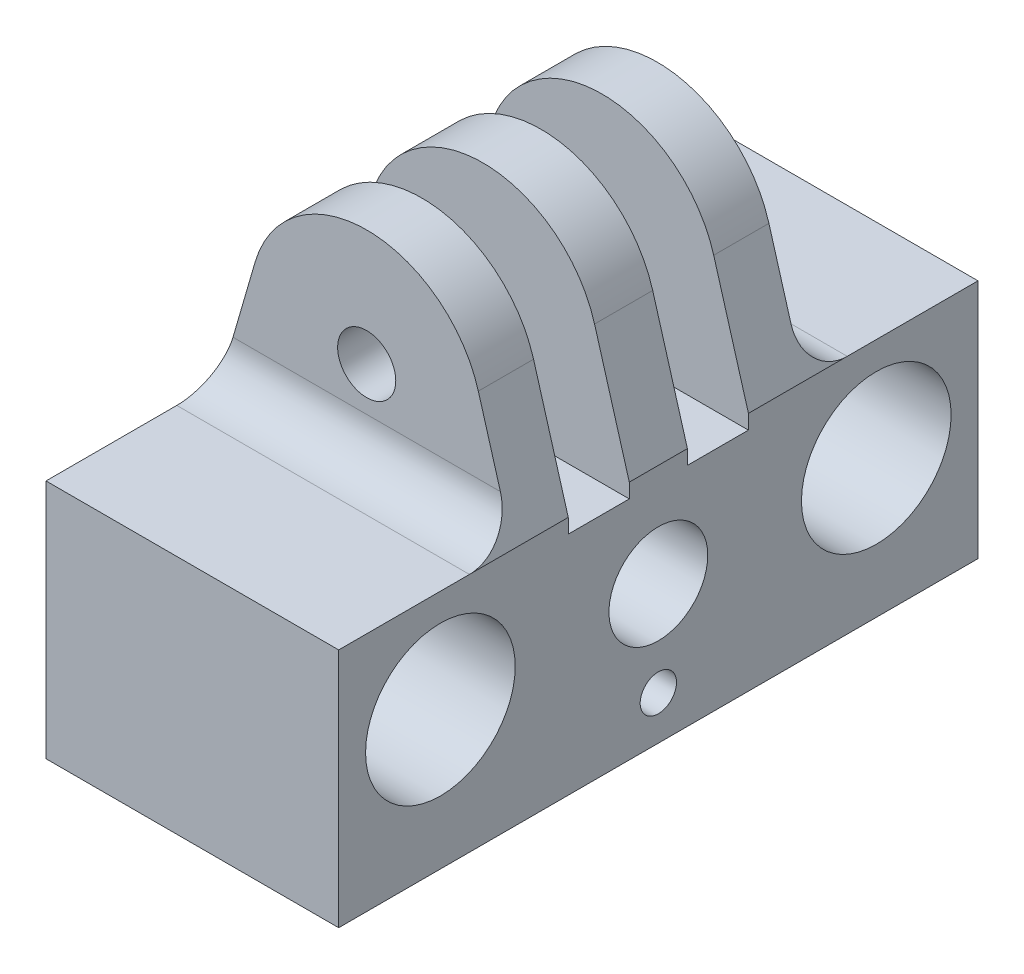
ISO-10303-21;
HEADER;
FILE_DESCRIPTION(('STEP AP214'),'2;1');
FILE_NAME('part.step','',(''),(''),'','','');
FILE_SCHEMA(('AUTOMOTIVE_DESIGN { 1 0 10303 214 1 1 1 1 }'));
ENDSEC;
DATA;
#1=APPLICATION_CONTEXT('core data for automotive mechanical design processes');
#2=APPLICATION_PROTOCOL_DEFINITION('international standard','automotive_design',2000,#1);
#3=PRODUCT_CONTEXT('',#1,'mechanical');
#4=PRODUCT('Part','Part','',(#3));
#5=PRODUCT_RELATED_PRODUCT_CATEGORY('part','',(#4));
#6=PRODUCT_DEFINITION_FORMATION('','',#4);
#7=PRODUCT_DEFINITION_CONTEXT('part definition',#1,'design');
#8=PRODUCT_DEFINITION('design','',#6,#7);
#9=PRODUCT_DEFINITION_SHAPE('','',#8);
#10=(LENGTH_UNIT() NAMED_UNIT(*) SI_UNIT(.MILLI.,.METRE.));
#11=(NAMED_UNIT(*) PLANE_ANGLE_UNIT() SI_UNIT($,.RADIAN.));
#12=(NAMED_UNIT(*) SI_UNIT($,.STERADIAN.) SOLID_ANGLE_UNIT());
#13=UNCERTAINTY_MEASURE_WITH_UNIT(LENGTH_MEASURE(1.E-05),#10,'distance_accuracy_value','');
#14=(GEOMETRIC_REPRESENTATION_CONTEXT(3) GLOBAL_UNCERTAINTY_ASSIGNED_CONTEXT((#13)) GLOBAL_UNIT_ASSIGNED_CONTEXT((#10,
#11,#12)) REPRESENTATION_CONTEXT('',''));
#15=CARTESIAN_POINT('',(0.,0.,0.));
#16=DIRECTION('',(0.,0.,1.));
#17=DIRECTION('',(1.,0.,0.));
#18=AXIS2_PLACEMENT_3D('',#15,#16,#17);
#19=CARTESIAN_POINT('',(0.,0.,20.));
#20=DIRECTION('',(0.,0.,1.));
#21=DIRECTION('',(1.,0.,0.));
#22=AXIS2_PLACEMENT_3D('',#19,#20,#21);
#23=PLANE('',#22);
#24=CARTESIAN_POINT('',(0.,20.,20.));
#25=DIRECTION('',(0.,0.,1.));
#26=DIRECTION('',(1.,0.,0.));
#27=AXIS2_PLACEMENT_3D('',#24,#25,#26);
#28=CIRCLE('',#27,2.);
#29=CARTESIAN_POINT('',(2.,20.,20.));
#30=VERTEX_POINT('',#29);
#31=EDGE_CURVE('E487',#30,#30,#28,.T.);
#32=ORIENTED_EDGE('',*,*,#31,.F.);
#33=EDGE_LOOP('',(#32));
#34=FACE_BOUND('',#33,.T.);
#35=CARTESIAN_POINT('',(0.,20.,20.));
#36=DIRECTION('',(0.,0.,1.));
#37=DIRECTION('',(1.,0.,0.));
#38=AXIS2_PLACEMENT_3D('',#35,#36,#37);
#39=CIRCLE('',#38,8.00008904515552);
#40=CARTESIAN_POINT('',(-7.68287417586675,22.2304414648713,20.));
#41=VERTEX_POINT('',#40);
#42=CARTESIAN_POINT('',(7.68287417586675,22.2304414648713,20.));
#43=VERTEX_POINT('',#42);
#44=EDGE_CURVE('E251',#41,#43,#39,.F.);
#45=ORIENTED_EDGE('',*,*,#44,.F.);
#46=DIRECTION('',(-0.278802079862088,-0.960348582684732,0.));
#47=VECTOR('',#46,1.);
#48=CARTESIAN_POINT('',(-13.037817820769,3.78505345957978,20.));
#49=LINE('',#48,#47);
#50=CARTESIAN_POINT('',(-9.20134151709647,17.,20.));
#51=VERTEX_POINT('',#50);
#52=EDGE_CURVE('E289',#41,#51,#49,.T.);
#53=ORIENTED_EDGE('',*,*,#52,.T.);
#54=DIRECTION('',(-1.,0.,0.));
#55=VECTOR('',#54,1.);
#56=CARTESIAN_POINT('',(10.0722817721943,17.,20.));
#57=LINE('',#56,#55);
#58=CARTESIAN_POINT('',(9.20134151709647,17.,20.));
#59=VERTEX_POINT('',#58);
#60=EDGE_CURVE('E271',#51,#59,#57,.F.);
#61=ORIENTED_EDGE('',*,*,#60,.T.);
#62=DIRECTION('',(0.278802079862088,-0.960348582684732,0.));
#63=VECTOR('',#62,1.);
#64=CARTESIAN_POINT('',(13.037817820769,3.78505345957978,20.));
#65=LINE('',#64,#63);
#66=EDGE_CURVE('E73',#43,#59,#65,.T.);
#67=ORIENTED_EDGE('',*,*,#66,.F.);
#68=EDGE_LOOP('',(#45,#53,#61,#67));
#69=FACE_BOUND('',#68,.T.);
#70=ADVANCED_FACE('F50',(#34,#69),#23,.T.);
#71=CARTESIAN_POINT('',(0.,0.,0.));
#72=DIRECTION('',(0.,0.,1.));
#73=DIRECTION('',(1.,0.,0.));
#74=AXIS2_PLACEMENT_3D('',#71,#72,#73);
#75=PLANE('',#74);
#76=CARTESIAN_POINT('',(0.,20.,0.));
#77=DIRECTION('',(0.,0.,1.));
#78=DIRECTION('',(1.,0.,0.));
#79=AXIS2_PLACEMENT_3D('',#76,#77,#78);
#80=CIRCLE('',#79,2.);
#81=CARTESIAN_POINT('',(2.,20.,0.));
#82=VERTEX_POINT('',#81);
#83=EDGE_CURVE('E485',#82,#82,#80,.T.);
#84=ORIENTED_EDGE('',*,*,#83,.T.);
#85=EDGE_LOOP('',(#84));
#86=FACE_BOUND('',#85,.T.);
#87=DIRECTION('',(-0.278802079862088,-0.960348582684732,0.));
#88=VECTOR('',#87,1.);
#89=CARTESIAN_POINT('',(-13.037817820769,3.78505345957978,0.));
#90=LINE('',#89,#88);
#91=CARTESIAN_POINT('',(-7.68287417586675,22.2304414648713,0.));
#92=VERTEX_POINT('',#91);
#93=CARTESIAN_POINT('',(-9.20134151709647,17.,0.));
#94=VERTEX_POINT('',#93);
#95=EDGE_CURVE('E285',#92,#94,#90,.T.);
#96=ORIENTED_EDGE('',*,*,#95,.F.);
#97=CARTESIAN_POINT('',(0.,20.,0.));
#98=DIRECTION('',(0.,0.,1.));
#99=DIRECTION('',(1.,0.,0.));
#100=AXIS2_PLACEMENT_3D('',#97,#98,#99);
#101=CIRCLE('',#100,8.00008904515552);
#102=CARTESIAN_POINT('',(7.68287417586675,22.2304414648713,0.));
#103=VERTEX_POINT('',#102);
#104=EDGE_CURVE('E260',#92,#103,#101,.F.);
#105=ORIENTED_EDGE('',*,*,#104,.T.);
#106=DIRECTION('',(0.278802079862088,-0.960348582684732,0.));
#107=VECTOR('',#106,1.);
#108=CARTESIAN_POINT('',(13.037817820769,3.78505345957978,0.));
#109=LINE('',#108,#107);
#110=CARTESIAN_POINT('',(9.20134151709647,17.,0.));
#111=VERTEX_POINT('',#110);
#112=EDGE_CURVE('E277',#103,#111,#109,.T.);
#113=ORIENTED_EDGE('',*,*,#112,.T.);
#114=DIRECTION('',(-1.,0.,0.));
#115=VECTOR('',#114,1.);
#116=CARTESIAN_POINT('',(0.,17.,0.));
#117=LINE('',#116,#115);
#118=EDGE_CURVE('E501',#111,#94,#117,.T.);
#119=ORIENTED_EDGE('',*,*,#118,.T.);
#120=EDGE_LOOP('',(#96,#105,#113,#119));
#121=FACE_BOUND('',#120,.T.);
#122=ADVANCED_FACE('F585',(#86,#121),#75,.F.);
#123=CARTESIAN_POINT('',(0.,20.,8.));
#124=DIRECTION('',(0.,0.,-1.));
#125=DIRECTION('',(-1.,0.,0.));
#126=AXIS2_PLACEMENT_3D('',#123,#124,#125);
#127=PLANE('',#126);
#128=CARTESIAN_POINT('',(0.,20.,8.));
#129=DIRECTION('',(0.,0.,-1.));
#130=DIRECTION('',(-1.,0.,0.));
#131=AXIS2_PLACEMENT_3D('',#128,#129,#130);
#132=CIRCLE('',#131,2.);
#133=CARTESIAN_POINT('',(-2.,20.,8.));
#134=VERTEX_POINT('',#133);
#135=EDGE_CURVE('E477',#134,#134,#132,.T.);
#136=ORIENTED_EDGE('',*,*,#135,.F.);
#137=EDGE_LOOP('',(#136));
#138=FACE_BOUND('',#137,.T.);
#139=DIRECTION('',(0.,1.,0.));
#140=VECTOR('',#139,1.);
#141=CARTESIAN_POINT('',(-10.0722817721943,20.,8.));
#142=LINE('',#141,#140);
#143=CARTESIAN_POINT('',(-10.0722817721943,13.,8.));
#144=VERTEX_POINT('',#143);
#145=CARTESIAN_POINT('',(-10.0722817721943,14.,8.));
#146=VERTEX_POINT('',#145);
#147=EDGE_CURVE('E470',#144,#146,#142,.T.);
#148=ORIENTED_EDGE('',*,*,#147,.T.);
#149=DIRECTION('',(0.278802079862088,0.960348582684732,0.));
#150=VECTOR('',#149,1.);
#151=CARTESIAN_POINT('',(-7.68287417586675,22.2304414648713,8.));
#152=LINE('',#151,#150);
#153=CARTESIAN_POINT('',(-7.68287417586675,22.2304414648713,8.));
#154=VERTEX_POINT('',#153);
#155=EDGE_CURVE('E297',#146,#154,#152,.T.);
#156=ORIENTED_EDGE('',*,*,#155,.T.);
#157=CARTESIAN_POINT('',(0.,20.,8.));
#158=DIRECTION('',(0.,0.,-1.));
#159=DIRECTION('',(-1.,0.,0.));
#160=AXIS2_PLACEMENT_3D('',#157,#158,#159);
#161=CIRCLE('',#160,8.00008904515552);
#162=CARTESIAN_POINT('',(7.68287417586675,22.2304414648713,8.));
#163=VERTEX_POINT('',#162);
#164=EDGE_CURVE('E305',#163,#154,#161,.F.);
#165=ORIENTED_EDGE('',*,*,#164,.F.);
#166=DIRECTION('',(-0.278802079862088,0.960348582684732,0.));
#167=VECTOR('',#166,1.);
#168=CARTESIAN_POINT('',(7.68287417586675,22.2304414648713,8.));
#169=LINE('',#168,#167);
#170=CARTESIAN_POINT('',(10.0722817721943,14.,8.));
#171=VERTEX_POINT('',#170);
#172=EDGE_CURVE('E283',#171,#163,#169,.T.);
#173=ORIENTED_EDGE('',*,*,#172,.F.);
#174=DIRECTION('',(0.,-1.,0.));
#175=VECTOR('',#174,1.);
#176=CARTESIAN_POINT('',(10.0722817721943,20.,8.));
#177=LINE('',#176,#175);
#178=CARTESIAN_POINT('',(10.0722817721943,13.,8.));
#179=VERTEX_POINT('',#178);
#180=EDGE_CURVE('E462',#171,#179,#177,.T.);
#181=ORIENTED_EDGE('',*,*,#180,.T.);
#182=DIRECTION('',(-1.,0.,0.));
#183=VECTOR('',#182,1.);
#184=CARTESIAN_POINT('',(10.875,13.,8.));
#185=LINE('',#184,#183);
#186=EDGE_CURVE('E483',#179,#144,#185,.T.);
#187=ORIENTED_EDGE('',*,*,#186,.T.);
#188=EDGE_LOOP('',(#148,#156,#165,#173,#181,#187));
#189=FACE_BOUND('',#188,.T.);
#190=ADVANCED_FACE('F651',(#138,#189),#127,.T.);
#191=CARTESIAN_POINT('',(0.,20.,12.));
#192=DIRECTION('',(0.,0.,-1.));
#193=DIRECTION('',(-1.,0.,0.));
#194=AXIS2_PLACEMENT_3D('',#191,#192,#193);
#195=PLANE('',#194);
#196=CARTESIAN_POINT('',(0.,20.,12.));
#197=DIRECTION('',(0.,0.,-1.));
#198=DIRECTION('',(-1.,0.,0.));
#199=AXIS2_PLACEMENT_3D('',#196,#197,#198);
#200=CIRCLE('',#199,2.);
#201=CARTESIAN_POINT('',(-2.,20.,12.));
#202=VERTEX_POINT('',#201);
#203=EDGE_CURVE('E476',#202,#202,#200,.T.);
#204=ORIENTED_EDGE('',*,*,#203,.T.);
#205=EDGE_LOOP('',(#204));
#206=FACE_BOUND('',#205,.T.);
#207=DIRECTION('',(0.278802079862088,0.960348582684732,0.));
#208=VECTOR('',#207,1.);
#209=CARTESIAN_POINT('',(-7.68287417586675,22.2304414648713,12.));
#210=LINE('',#209,#208);
#211=CARTESIAN_POINT('',(-10.0722817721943,14.,12.));
#212=VERTEX_POINT('',#211);
#213=CARTESIAN_POINT('',(-7.68287417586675,22.2304414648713,12.));
#214=VERTEX_POINT('',#213);
#215=EDGE_CURVE('E295',#212,#214,#210,.T.);
#216=ORIENTED_EDGE('',*,*,#215,.F.);
#217=DIRECTION('',(0.,1.,0.));
#218=VECTOR('',#217,1.);
#219=CARTESIAN_POINT('',(-10.0722817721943,20.,12.));
#220=LINE('',#219,#218);
#221=CARTESIAN_POINT('',(-10.0722817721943,13.,12.));
#222=VERTEX_POINT('',#221);
#223=EDGE_CURVE('E490',#222,#212,#220,.T.);
#224=ORIENTED_EDGE('',*,*,#223,.F.);
#225=DIRECTION('',(-1.,0.,0.));
#226=VECTOR('',#225,1.);
#227=CARTESIAN_POINT('',(10.875,13.,12.));
#228=LINE('',#227,#226);
#229=CARTESIAN_POINT('',(10.0722817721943,13.,12.));
#230=VERTEX_POINT('',#229);
#231=EDGE_CURVE('E480',#230,#222,#228,.T.);
#232=ORIENTED_EDGE('',*,*,#231,.F.);
#233=DIRECTION('',(0.,-1.,0.));
#234=VECTOR('',#233,1.);
#235=CARTESIAN_POINT('',(10.0722817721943,20.,12.));
#236=LINE('',#235,#234);
#237=CARTESIAN_POINT('',(10.0722817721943,14.,12.));
#238=VERTEX_POINT('',#237);
#239=EDGE_CURVE('E457',#238,#230,#236,.T.);
#240=ORIENTED_EDGE('',*,*,#239,.F.);
#241=DIRECTION('',(-0.278802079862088,0.960348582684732,0.));
#242=VECTOR('',#241,1.);
#243=CARTESIAN_POINT('',(7.68287417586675,22.2304414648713,12.));
#244=LINE('',#243,#242);
#245=CARTESIAN_POINT('',(7.68287417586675,22.2304414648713,12.));
#246=VERTEX_POINT('',#245);
#247=EDGE_CURVE('E65',#238,#246,#244,.T.);
#248=ORIENTED_EDGE('',*,*,#247,.T.);
#249=CARTESIAN_POINT('',(0.,20.,12.));
#250=DIRECTION('',(0.,0.,-1.));
#251=DIRECTION('',(-1.,0.,0.));
#252=AXIS2_PLACEMENT_3D('',#249,#250,#251);
#253=CIRCLE('',#252,8.00008904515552);
#254=EDGE_CURVE('E302',#246,#214,#253,.F.);
#255=ORIENTED_EDGE('',*,*,#254,.T.);
#256=EDGE_LOOP('',(#216,#224,#232,#240,#248,#255));
#257=FACE_BOUND('',#256,.T.);
#258=ADVANCED_FACE('F866',(#206,#257),#195,.F.);
#259=CARTESIAN_POINT('',(-10.0722817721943,0.,-11.));
#260=DIRECTION('',(-1.,0.,0.));
#261=DIRECTION('',(0.,-1.,0.));
#262=AXIS2_PLACEMENT_3D('',#259,#260,#261);
#263=PLANE('',#262);
#264=CARTESIAN_POINT('',(-10.0722817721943,6.94401265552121,10.));
#265=DIRECTION('',(-1.,0.,0.));
#266=DIRECTION('',(0.,-1.,0.));
#267=AXIS2_PLACEMENT_3D('',#264,#265,#266);
#268=CIRCLE('',#267,3.4);
#269=CARTESIAN_POINT('',(-10.0722817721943,3.54401265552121,10.));
#270=VERTEX_POINT('',#269);
#271=EDGE_CURVE('E454',#270,#270,#268,.T.);
#272=ORIENTED_EDGE('',*,*,#271,.F.);
#273=EDGE_LOOP('',(#272));
#274=FACE_BOUND('',#273,.T.);
#275=CARTESIAN_POINT('',(-10.0722817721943,6.94401265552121,-5.));
#276=DIRECTION('',(-1.,0.,0.));
#277=DIRECTION('',(0.,-1.,0.));
#278=AXIS2_PLACEMENT_3D('',#275,#276,#277);
#279=CIRCLE('',#278,5.15);
#280=CARTESIAN_POINT('',(-10.0722817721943,1.79401265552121,-5.));
#281=VERTEX_POINT('',#280);
#282=EDGE_CURVE('E360',#281,#281,#279,.T.);
#283=ORIENTED_EDGE('',*,*,#282,.F.);
#284=EDGE_LOOP('',(#283));
#285=FACE_BOUND('',#284,.T.);
#286=CARTESIAN_POINT('',(-10.0722817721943,6.94401265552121,25.));
#287=DIRECTION('',(-1.,0.,0.));
#288=DIRECTION('',(0.,-1.,0.));
#289=AXIS2_PLACEMENT_3D('',#286,#287,#288);
#290=CIRCLE('',#289,5.15);
#291=CARTESIAN_POINT('',(-10.0722817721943,1.79401265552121,25.));
#292=VERTEX_POINT('',#291);
#293=EDGE_CURVE('E354',#292,#292,#290,.T.);
#294=ORIENTED_EDGE('',*,*,#293,.F.);
#295=EDGE_LOOP('',(#294));
#296=FACE_BOUND('',#295,.T.);
#297=CARTESIAN_POINT('',(-10.0722817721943,0.444012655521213,10.));
#298=DIRECTION('',(-1.,0.,0.));
#299=DIRECTION('',(0.,-1.,0.));
#300=AXIS2_PLACEMENT_3D('',#297,#298,#299);
#301=CIRCLE('',#300,1.25);
#302=CARTESIAN_POINT('',(-10.0722817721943,-0.805987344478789,10.));
#303=VERTEX_POINT('',#302);
#304=EDGE_CURVE('E315',#303,#303,#301,.T.);
#305=ORIENTED_EDGE('',*,*,#304,.F.);
#306=EDGE_LOOP('',(#305));
#307=FACE_BOUND('',#306,.T.);
#308=DIRECTION('',(0.,0.,-1.));
#309=VECTOR('',#308,1.);
#310=CARTESIAN_POINT('',(-10.0722817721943,14.,20.));
#311=LINE('',#310,#309);
#312=CARTESIAN_POINT('',(-10.0722817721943,14.,32.));
#313=VERTEX_POINT('',#312);
#314=CARTESIAN_POINT('',(-10.0722817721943,14.,23.));
#315=VERTEX_POINT('',#314);
#316=EDGE_CURVE('E366',#313,#315,#311,.T.);
#317=ORIENTED_EDGE('',*,*,#316,.T.);
#318=DIRECTION('',(0.,0.,-1.));
#319=VECTOR('',#318,1.);
#320=CARTESIAN_POINT('',(-10.0722817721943,14.,30.));
#321=LINE('',#320,#319);
#322=CARTESIAN_POINT('',(-10.0722817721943,14.,16.2));
#323=VERTEX_POINT('',#322);
#324=EDGE_CURVE('E586',#315,#323,#321,.T.);
#325=ORIENTED_EDGE('',*,*,#324,.T.);
#326=DIRECTION('',(0.,1.,0.));
#327=VECTOR('',#326,1.);
#328=CARTESIAN_POINT('',(-10.0722817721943,0.,16.2));
#329=LINE('',#328,#327);
#330=CARTESIAN_POINT('',(-10.0722817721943,13.,16.2));
#331=VERTEX_POINT('',#330);
#332=EDGE_CURVE('E403',#331,#323,#329,.T.);
#333=ORIENTED_EDGE('',*,*,#332,.F.);
#334=DIRECTION('',(0.,0.,-1.));
#335=VECTOR('',#334,1.);
#336=CARTESIAN_POINT('',(-10.0722817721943,13.,0.));
#337=LINE('',#336,#335);
#338=EDGE_CURVE('E467',#331,#222,#337,.T.);
#339=ORIENTED_EDGE('',*,*,#338,.T.);
#340=ORIENTED_EDGE('',*,*,#223,.T.);
#341=EDGE_CURVE('E588',#212,#146,#321,.T.);
#342=ORIENTED_EDGE('',*,*,#341,.T.);
#343=ORIENTED_EDGE('',*,*,#147,.F.);
#344=DIRECTION('',(0.,0.,-1.));
#345=VECTOR('',#344,1.);
#346=CARTESIAN_POINT('',(-10.0722817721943,13.,0.));
#347=LINE('',#346,#345);
#348=CARTESIAN_POINT('',(-10.0722817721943,13.,3.8));
#349=VERTEX_POINT('',#348);
#350=EDGE_CURVE('E473',#144,#349,#347,.T.);
#351=ORIENTED_EDGE('',*,*,#350,.T.);
#352=DIRECTION('',(0.,-1.,0.));
#353=VECTOR('',#352,1.);
#354=CARTESIAN_POINT('',(-10.0722817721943,0.,3.8));
#355=LINE('',#354,#353);
#356=CARTESIAN_POINT('',(-10.0722817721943,14.,3.8));
#357=VERTEX_POINT('',#356);
#358=EDGE_CURVE('E395',#357,#349,#355,.T.);
#359=ORIENTED_EDGE('',*,*,#358,.F.);
#360=CARTESIAN_POINT('',(-10.0722817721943,14.,-3.));
#361=VERTEX_POINT('',#360);
#362=EDGE_CURVE('E590',#357,#361,#321,.T.);
#363=ORIENTED_EDGE('',*,*,#362,.T.);
#364=DIRECTION('',(0.,0.,-1.));
#365=VECTOR('',#364,1.);
#366=CARTESIAN_POINT('',(-10.0722817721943,14.,-12.));
#367=LINE('',#366,#365);
#368=CARTESIAN_POINT('',(-10.0722817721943,14.,-12.));
#369=VERTEX_POINT('',#368);
#370=EDGE_CURVE('E371',#361,#369,#367,.T.);
#371=ORIENTED_EDGE('',*,*,#370,.T.);
#372=DIRECTION('',(0.,1.,0.));
#373=VECTOR('',#372,1.);
#374=CARTESIAN_POINT('',(-10.0722817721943,13.,-12.));
#375=LINE('',#374,#373);
#376=CARTESIAN_POINT('',(-10.0722817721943,-2.56000000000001,-12.));
#377=VERTEX_POINT('',#376);
#378=EDGE_CURVE('E384',#377,#369,#375,.T.);
#379=ORIENTED_EDGE('',*,*,#378,.F.);
#380=DIRECTION('',(0.,0.,-1.));
#381=VECTOR('',#380,1.);
#382=CARTESIAN_POINT('',(-10.0722817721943,-2.56000000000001,32.));
#383=LINE('',#382,#381);
#384=CARTESIAN_POINT('',(-10.0722817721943,-2.56000000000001,32.));
#385=VERTEX_POINT('',#384);
#386=EDGE_CURVE('E351',#385,#377,#383,.T.);
#387=ORIENTED_EDGE('',*,*,#386,.F.);
#388=DIRECTION('',(0.,-1.,0.));
#389=VECTOR('',#388,1.);
#390=CARTESIAN_POINT('',(-10.0722817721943,13.,32.));
#391=LINE('',#390,#389);
#392=EDGE_CURVE('E380',#313,#385,#391,.T.);
#393=ORIENTED_EDGE('',*,*,#392,.F.);
#394=EDGE_LOOP('',(#317,#325,#333,#339,#340,#342,#343,#351,#359,#363,#371,#379,#387,#393));
#395=FACE_BOUND('',#394,.T.);
#396=ADVANCED_FACE('F556',(#274,#285,#296,#307,#395),#263,.T.);
#397=CARTESIAN_POINT('',(10.0722817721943,0.,-11.));
#398=DIRECTION('',(1.,0.,0.));
#399=DIRECTION('',(0.,0.,-1.));
#400=AXIS2_PLACEMENT_3D('',#397,#398,#399);
#401=PLANE('',#400);
#402=CARTESIAN_POINT('',(10.0722817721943,6.94401265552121,10.));
#403=DIRECTION('',(1.,0.,0.));
#404=DIRECTION('',(0.,0.,-1.));
#405=AXIS2_PLACEMENT_3D('',#402,#403,#404);
#406=CIRCLE('',#405,3.4);
#407=CARTESIAN_POINT('',(10.0722817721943,6.94401265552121,6.6));
#408=VERTEX_POINT('',#407);
#409=EDGE_CURVE('E451',#408,#408,#406,.T.);
#410=ORIENTED_EDGE('',*,*,#409,.F.);
#411=EDGE_LOOP('',(#410));
#412=FACE_BOUND('',#411,.T.);
#413=CARTESIAN_POINT('',(10.0722817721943,6.94401265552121,-5.));
#414=DIRECTION('',(1.,0.,0.));
#415=DIRECTION('',(0.,0.,-1.));
#416=AXIS2_PLACEMENT_3D('',#413,#414,#415);
#417=CIRCLE('',#416,5.15);
#418=CARTESIAN_POINT('',(10.0722817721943,6.94401265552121,-10.15));
#419=VERTEX_POINT('',#418);
#420=EDGE_CURVE('E363',#419,#419,#417,.T.);
#421=ORIENTED_EDGE('',*,*,#420,.F.);
#422=EDGE_LOOP('',(#421));
#423=FACE_BOUND('',#422,.T.);
#424=CARTESIAN_POINT('',(10.0722817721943,6.94401265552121,25.));
#425=DIRECTION('',(1.,0.,0.));
#426=DIRECTION('',(0.,0.,-1.));
#427=AXIS2_PLACEMENT_3D('',#424,#425,#426);
#428=CIRCLE('',#427,5.15);
#429=CARTESIAN_POINT('',(10.0722817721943,6.94401265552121,19.85));
#430=VERTEX_POINT('',#429);
#431=EDGE_CURVE('E357',#430,#430,#428,.T.);
#432=ORIENTED_EDGE('',*,*,#431,.F.);
#433=EDGE_LOOP('',(#432));
#434=FACE_BOUND('',#433,.T.);
#435=CARTESIAN_POINT('',(10.0722817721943,0.444012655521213,10.));
#436=DIRECTION('',(1.,0.,0.));
#437=DIRECTION('',(0.,0.,-1.));
#438=AXIS2_PLACEMENT_3D('',#435,#436,#437);
#439=CIRCLE('',#438,1.25);
#440=CARTESIAN_POINT('',(10.0722817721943,0.444012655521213,8.75));
#441=VERTEX_POINT('',#440);
#442=EDGE_CURVE('E259',#441,#441,#439,.T.);
#443=ORIENTED_EDGE('',*,*,#442,.F.);
#444=EDGE_LOOP('',(#443));
#445=FACE_BOUND('',#444,.T.);
#446=DIRECTION('',(0.,0.,-1.));
#447=VECTOR('',#446,1.);
#448=CARTESIAN_POINT('',(10.0722817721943,14.,-12.));
#449=LINE('',#448,#447);
#450=CARTESIAN_POINT('',(10.0722817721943,14.,-3.));
#451=VERTEX_POINT('',#450);
#452=CARTESIAN_POINT('',(10.0722817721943,14.,-12.));
#453=VERTEX_POINT('',#452);
#454=EDGE_CURVE('E375',#451,#453,#449,.T.);
#455=ORIENTED_EDGE('',*,*,#454,.F.);
#456=DIRECTION('',(0.,0.,-1.));
#457=VECTOR('',#456,1.);
#458=CARTESIAN_POINT('',(10.0722817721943,14.,30.));
#459=LINE('',#458,#457);
#460=CARTESIAN_POINT('',(10.0722817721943,14.,3.8));
#461=VERTEX_POINT('',#460);
#462=EDGE_CURVE('E567',#461,#451,#459,.T.);
#463=ORIENTED_EDGE('',*,*,#462,.F.);
#464=DIRECTION('',(0.,1.,0.));
#465=VECTOR('',#464,1.);
#466=CARTESIAN_POINT('',(10.0722817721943,13.,3.8));
#467=LINE('',#466,#465);
#468=CARTESIAN_POINT('',(10.0722817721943,13.,3.8));
#469=VERTEX_POINT('',#468);
#470=EDGE_CURVE('E389',#469,#461,#467,.T.);
#471=ORIENTED_EDGE('',*,*,#470,.F.);
#472=DIRECTION('',(0.,0.,1.));
#473=VECTOR('',#472,1.);
#474=CARTESIAN_POINT('',(10.0722817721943,13.,0.));
#475=LINE('',#474,#473);
#476=EDGE_CURVE('E464',#469,#179,#475,.T.);
#477=ORIENTED_EDGE('',*,*,#476,.T.);
#478=ORIENTED_EDGE('',*,*,#180,.F.);
#479=EDGE_CURVE('E597',#238,#171,#459,.T.);
#480=ORIENTED_EDGE('',*,*,#479,.F.);
#481=ORIENTED_EDGE('',*,*,#239,.T.);
#482=DIRECTION('',(0.,0.,1.));
#483=VECTOR('',#482,1.);
#484=CARTESIAN_POINT('',(10.0722817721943,13.,0.));
#485=LINE('',#484,#483);
#486=CARTESIAN_POINT('',(10.0722817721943,13.,16.2));
#487=VERTEX_POINT('',#486);
#488=EDGE_CURVE('E459',#230,#487,#485,.T.);
#489=ORIENTED_EDGE('',*,*,#488,.T.);
#490=DIRECTION('',(0.,-1.,0.));
#491=VECTOR('',#490,1.);
#492=CARTESIAN_POINT('',(10.0722817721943,0.,16.2));
#493=LINE('',#492,#491);
#494=CARTESIAN_POINT('',(10.0722817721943,14.,16.2));
#495=VERTEX_POINT('',#494);
#496=EDGE_CURVE('E495',#495,#487,#493,.T.);
#497=ORIENTED_EDGE('',*,*,#496,.F.);
#498=CARTESIAN_POINT('',(10.0722817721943,14.,23.));
#499=VERTEX_POINT('',#498);
#500=EDGE_CURVE('E596',#499,#495,#459,.T.);
#501=ORIENTED_EDGE('',*,*,#500,.F.);
#502=DIRECTION('',(0.,0.,-1.));
#503=VECTOR('',#502,1.);
#504=CARTESIAN_POINT('',(10.0722817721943,14.,20.));
#505=LINE('',#504,#503);
#506=CARTESIAN_POINT('',(10.0722817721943,14.,32.));
#507=VERTEX_POINT('',#506);
#508=EDGE_CURVE('E369',#507,#499,#505,.T.);
#509=ORIENTED_EDGE('',*,*,#508,.F.);
#510=DIRECTION('',(0.,1.,0.));
#511=VECTOR('',#510,1.);
#512=CARTESIAN_POINT('',(10.0722817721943,0.,32.));
#513=LINE('',#512,#511);
#514=CARTESIAN_POINT('',(10.0722817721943,-2.56,32.));
#515=VERTEX_POINT('',#514);
#516=EDGE_CURVE('E382',#515,#507,#513,.T.);
#517=ORIENTED_EDGE('',*,*,#516,.F.);
#518=DIRECTION('',(0.,0.,1.));
#519=VECTOR('',#518,1.);
#520=CARTESIAN_POINT('',(10.0722817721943,-2.56,-12.));
#521=LINE('',#520,#519);
#522=CARTESIAN_POINT('',(10.0722817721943,-2.56,-12.));
#523=VERTEX_POINT('',#522);
#524=EDGE_CURVE('E345',#523,#515,#521,.T.);
#525=ORIENTED_EDGE('',*,*,#524,.F.);
#526=DIRECTION('',(0.,-1.,0.));
#527=VECTOR('',#526,1.);
#528=CARTESIAN_POINT('',(10.0722817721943,0.,-12.));
#529=LINE('',#528,#527);
#530=EDGE_CURVE('E387',#453,#523,#529,.T.);
#531=ORIENTED_EDGE('',*,*,#530,.F.);
#532=EDGE_LOOP('',(#455,#463,#471,#477,#478,#480,#481,#489,#497,#501,#509,#517,#525,#531));
#533=FACE_BOUND('',#532,.T.);
#534=ADVANCED_FACE('F552',(#412,#423,#434,#445,#533),#401,.T.);
#535=CARTESIAN_POINT('',(-15.9277182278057,13.,16.2));
#536=DIRECTION('',(0.,0.,1.));
#537=DIRECTION('',(1.,0.,0.));
#538=AXIS2_PLACEMENT_3D('',#535,#536,#537);
#539=PLANE('',#538);
#540=CARTESIAN_POINT('',(0.,20.,16.2));
#541=DIRECTION('',(0.,0.,1.));
#542=DIRECTION('',(1.,0.,0.));
#543=AXIS2_PLACEMENT_3D('',#540,#541,#542);
#544=CIRCLE('',#543,2.);
#545=CARTESIAN_POINT('',(2.,20.,16.2));
#546=VERTEX_POINT('',#545);
#547=EDGE_CURVE('E406',#546,#546,#544,.T.);
#548=ORIENTED_EDGE('',*,*,#547,.T.);
#549=EDGE_LOOP('',(#548));
#550=FACE_BOUND('',#549,.T.);
#551=DIRECTION('',(-0.278802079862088,-0.960348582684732,0.));
#552=VECTOR('',#551,1.);
#553=CARTESIAN_POINT('',(-10.7951755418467,11.5099539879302,16.2));
#554=LINE('',#553,#552);
#555=CARTESIAN_POINT('',(-7.68287417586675,22.2304414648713,16.2));
#556=VERTEX_POINT('',#555);
#557=EDGE_CURVE('E293',#556,#323,#554,.T.);
#558=ORIENTED_EDGE('',*,*,#557,.F.);
#559=CARTESIAN_POINT('',(0.,20.,16.2));
#560=DIRECTION('',(0.,0.,1.));
#561=DIRECTION('',(1.,0.,0.));
#562=AXIS2_PLACEMENT_3D('',#559,#560,#561);
#563=CIRCLE('',#562,8.00008904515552);
#564=CARTESIAN_POINT('',(7.68287417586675,22.2304414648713,16.2));
#565=VERTEX_POINT('',#564);
#566=EDGE_CURVE('E300',#556,#565,#563,.F.);
#567=ORIENTED_EDGE('',*,*,#566,.T.);
#568=DIRECTION('',(0.278802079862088,-0.960348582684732,0.));
#569=VECTOR('',#568,1.);
#570=CARTESIAN_POINT('',(8.31903336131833,20.0391573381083,16.2));
#571=LINE('',#570,#569);
#572=EDGE_CURVE('E264',#565,#495,#571,.T.);
#573=ORIENTED_EDGE('',*,*,#572,.T.);
#574=ORIENTED_EDGE('',*,*,#496,.T.);
#575=DIRECTION('',(1.,0.,0.));
#576=VECTOR('',#575,1.);
#577=CARTESIAN_POINT('',(-15.9277182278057,13.,16.2));
#578=LINE('',#577,#576);
#579=EDGE_CURVE('E400',#331,#487,#578,.T.);
#580=ORIENTED_EDGE('',*,*,#579,.F.);
#581=ORIENTED_EDGE('',*,*,#332,.T.);
#582=EDGE_LOOP('',(#558,#567,#573,#574,#580,#581));
#583=FACE_BOUND('',#582,.T.);
#584=ADVANCED_FACE('F555',(#550,#583),#539,.F.);
#585=CARTESIAN_POINT('',(-15.9277182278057,13.,3.8));
#586=DIRECTION('',(0.,0.,-1.));
#587=DIRECTION('',(-1.,0.,0.));
#588=AXIS2_PLACEMENT_3D('',#585,#586,#587);
#589=PLANE('',#588);
#590=CARTESIAN_POINT('',(0.,20.,3.8));
#591=DIRECTION('',(0.,0.,-1.));
#592=DIRECTION('',(-1.,0.,0.));
#593=AXIS2_PLACEMENT_3D('',#590,#591,#592);
#594=CIRCLE('',#593,2.);
#595=CARTESIAN_POINT('',(-2.,20.,3.8));
#596=VERTEX_POINT('',#595);
#597=EDGE_CURVE('E397',#596,#596,#594,.T.);
#598=ORIENTED_EDGE('',*,*,#597,.T.);
#599=EDGE_LOOP('',(#598));
#600=FACE_BOUND('',#599,.T.);
#601=DIRECTION('',(0.278802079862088,0.960348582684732,0.));
#602=VECTOR('',#601,1.);
#603=CARTESIAN_POINT('',(-10.7951755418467,11.5099539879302,3.8));
#604=LINE('',#603,#602);
#605=CARTESIAN_POINT('',(-7.68287417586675,22.2304414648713,3.8));
#606=VERTEX_POINT('',#605);
#607=EDGE_CURVE('E291',#357,#606,#604,.T.);
#608=ORIENTED_EDGE('',*,*,#607,.F.);
#609=ORIENTED_EDGE('',*,*,#358,.T.);
#610=DIRECTION('',(1.,0.,0.));
#611=VECTOR('',#610,1.);
#612=CARTESIAN_POINT('',(-15.9277182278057,13.,3.8));
#613=LINE('',#612,#611);
#614=EDGE_CURVE('E392',#349,#469,#613,.T.);
#615=ORIENTED_EDGE('',*,*,#614,.T.);
#616=ORIENTED_EDGE('',*,*,#470,.T.);
#617=DIRECTION('',(-0.278802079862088,0.960348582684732,0.));
#618=VECTOR('',#617,1.);
#619=CARTESIAN_POINT('',(8.31903336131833,20.0391573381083,3.8));
#620=LINE('',#619,#618);
#621=CARTESIAN_POINT('',(7.68287417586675,22.2304414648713,3.8));
#622=VERTEX_POINT('',#621);
#623=EDGE_CURVE('E272',#461,#622,#620,.T.);
#624=ORIENTED_EDGE('',*,*,#623,.T.);
#625=CARTESIAN_POINT('',(0.,20.,3.8));
#626=DIRECTION('',(0.,0.,-1.));
#627=DIRECTION('',(-1.,0.,0.));
#628=AXIS2_PLACEMENT_3D('',#625,#626,#627);
#629=CIRCLE('',#628,8.00008904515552);
#630=EDGE_CURVE('E514',#622,#606,#629,.F.);
#631=ORIENTED_EDGE('',*,*,#630,.T.);
#632=EDGE_LOOP('',(#608,#609,#615,#616,#624,#631));
#633=FACE_BOUND('',#632,.T.);
#634=ADVANCED_FACE('F666',(#600,#633),#589,.F.);
#635=CARTESIAN_POINT('',(22.1138763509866,17.,23.));
#636=DIRECTION('',(1.,0.,0.));
#637=DIRECTION('',(0.,1.,0.));
#638=AXIS2_PLACEMENT_3D('',#635,#636,#637);
#639=CYLINDRICAL_SURFACE('',#638,3.);
#640=CARTESIAN_POINT('',(-9.20134151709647,17.,23.));
#641=DIRECTION('',(-0.960348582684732,0.278802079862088,0.));
#642=DIRECTION('',(0.278802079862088,0.960348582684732,0.));
#643=AXIS2_PLACEMENT_3D('',#640,#641,#642);
#644=ELLIPSE('',#643,3.12386570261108,3.);
#645=EDGE_CURVE('E287',#315,#51,#644,.F.);
#646=ORIENTED_EDGE('',*,*,#645,.F.);
#647=DIRECTION('',(-1.,0.,0.));
#648=VECTOR('',#647,1.);
#649=CARTESIAN_POINT('',(-10.0722817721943,14.,23.));
#650=LINE('',#649,#648);
#651=EDGE_CURVE('E497',#499,#315,#650,.T.);
#652=ORIENTED_EDGE('',*,*,#651,.F.);
#653=CARTESIAN_POINT('',(9.20134151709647,17.,23.));
#654=DIRECTION('',(-0.960348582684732,-0.278802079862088,0.));
#655=DIRECTION('',(0.278802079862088,-0.960348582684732,0.));
#656=AXIS2_PLACEMENT_3D('',#653,#654,#655);
#657=ELLIPSE('',#656,3.12386570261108,3.);
#658=EDGE_CURVE('E273',#499,#59,#657,.F.);
#659=ORIENTED_EDGE('',*,*,#658,.T.);
#660=ORIENTED_EDGE('',*,*,#60,.F.);
#661=EDGE_LOOP('',(#646,#652,#659,#660));
#662=FACE_BOUND('',#661,.T.);
#663=ADVANCED_FACE('F619',(#662),#639,.F.);
#664=CARTESIAN_POINT('',(0.,17.,-3.));
#665=DIRECTION('',(-1.,0.,0.));
#666=DIRECTION('',(0.,-1.,0.));
#667=AXIS2_PLACEMENT_3D('',#664,#665,#666);
#668=CYLINDRICAL_SURFACE('',#667,3.);
#669=CARTESIAN_POINT('',(-9.20134151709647,17.,-3.));
#670=DIRECTION('',(-0.960348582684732,0.278802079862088,0.));
#671=DIRECTION('',(-0.278802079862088,-0.960348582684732,0.));
#672=AXIS2_PLACEMENT_3D('',#669,#670,#671);
#673=ELLIPSE('',#672,3.12386570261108,3.);
#674=EDGE_CURVE('E512',#94,#361,#673,.F.);
#675=ORIENTED_EDGE('',*,*,#674,.F.);
#676=ORIENTED_EDGE('',*,*,#118,.F.);
#677=CARTESIAN_POINT('',(9.20134151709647,17.,-3.));
#678=DIRECTION('',(-0.960348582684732,-0.278802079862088,0.));
#679=DIRECTION('',(-0.278802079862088,0.960348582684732,0.));
#680=AXIS2_PLACEMENT_3D('',#677,#678,#679);
#681=ELLIPSE('',#680,3.12386570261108,3.);
#682=EDGE_CURVE('E507',#111,#451,#681,.F.);
#683=ORIENTED_EDGE('',*,*,#682,.T.);
#684=DIRECTION('',(-1.,0.,0.));
#685=VECTOR('',#684,1.);
#686=CARTESIAN_POINT('',(22.1138763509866,14.,-3.));
#687=LINE('',#686,#685);
#688=EDGE_CURVE('E504',#361,#451,#687,.F.);
#689=ORIENTED_EDGE('',*,*,#688,.F.);
#690=EDGE_LOOP('',(#675,#676,#683,#689));
#691=FACE_BOUND('',#690,.T.);
#692=ADVANCED_FACE('F576',(#691),#668,.F.);
#693=CARTESIAN_POINT('',(-22.9277182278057,6.94401265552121,10.));
#694=DIRECTION('',(1.,0.,0.));
#695=DIRECTION('',(0.,0.,-1.));
#696=AXIS2_PLACEMENT_3D('',#693,#694,#695);
#697=CYLINDRICAL_SURFACE('',#696,3.4);
#698=ORIENTED_EDGE('',*,*,#409,.T.);
#699=EDGE_LOOP('',(#698));
#700=FACE_BOUND('',#699,.T.);
#701=CARTESIAN_POINT('',(5.,6.94401265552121,10.));
#702=DIRECTION('',(-1.,0.,0.));
#703=DIRECTION('',(0.,0.,1.));
#704=AXIS2_PLACEMENT_3D('',#701,#702,#703);
#705=CIRCLE('',#704,3.4);
#706=CARTESIAN_POINT('',(5.,6.94401265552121,13.4));
#707=VERTEX_POINT('',#706);
#708=EDGE_CURVE('E448',#707,#707,#705,.F.);
#709=ORIENTED_EDGE('',*,*,#708,.F.);
#710=EDGE_LOOP('',(#709));
#711=FACE_BOUND('',#710,.T.);
#712=ADVANCED_FACE('F669',(#700,#711),#697,.F.);
#713=CARTESIAN_POINT('',(0.,13.,0.));
#714=DIRECTION('',(0.,-1.,0.));
#715=DIRECTION('',(0.,0.,-1.));
#716=AXIS2_PLACEMENT_3D('',#713,#714,#715);
#717=PLANE('',#716);
#718=ORIENTED_EDGE('',*,*,#488,.F.);
#719=ORIENTED_EDGE('',*,*,#231,.T.);
#720=ORIENTED_EDGE('',*,*,#338,.F.);
#721=ORIENTED_EDGE('',*,*,#579,.T.);
#722=EDGE_LOOP('',(#718,#719,#720,#721));
#723=FACE_BOUND('',#722,.T.);
#724=ADVANCED_FACE('F609',(#723),#717,.F.);
#725=ORIENTED_EDGE('',*,*,#476,.F.);
#726=ORIENTED_EDGE('',*,*,#614,.F.);
#727=ORIENTED_EDGE('',*,*,#350,.F.);
#728=ORIENTED_EDGE('',*,*,#186,.F.);
#729=EDGE_LOOP('',(#725,#726,#727,#728));
#730=FACE_BOUND('',#729,.T.);
#731=ADVANCED_FACE('F904',(#730),#717,.F.);
#732=CARTESIAN_POINT('',(0.,20.,20.));
#733=DIRECTION('',(0.,0.,-1.));
#734=DIRECTION('',(-1.,0.,0.));
#735=AXIS2_PLACEMENT_3D('',#732,#733,#734);
#736=CYLINDRICAL_SURFACE('',#735,2.);
#737=ORIENTED_EDGE('',*,*,#547,.F.);
#738=EDGE_LOOP('',(#737));
#739=FACE_BOUND('',#738,.T.);
#740=ORIENTED_EDGE('',*,*,#31,.T.);
#741=EDGE_LOOP('',(#740));
#742=FACE_BOUND('',#741,.T.);
#743=ADVANCED_FACE('F662',(#739,#742),#736,.F.);
#744=ORIENTED_EDGE('',*,*,#597,.F.);
#745=EDGE_LOOP('',(#744));
#746=FACE_BOUND('',#745,.T.);
#747=ORIENTED_EDGE('',*,*,#83,.F.);
#748=EDGE_LOOP('',(#747));
#749=FACE_BOUND('',#748,.T.);
#750=ADVANCED_FACE('F658',(#746,#749),#736,.F.);
#751=CARTESIAN_POINT('',(0.,20.,8.));
#752=DIRECTION('',(0.,0.,1.));
#753=DIRECTION('',(1.,0.,0.));
#754=AXIS2_PLACEMENT_3D('',#751,#752,#753);
#755=CYLINDRICAL_SURFACE('',#754,2.);
#756=ORIENTED_EDGE('',*,*,#135,.T.);
#757=EDGE_LOOP('',(#756));
#758=FACE_BOUND('',#757,.T.);
#759=ORIENTED_EDGE('',*,*,#203,.F.);
#760=EDGE_LOOP('',(#759));
#761=FACE_BOUND('',#760,.T.);
#762=ADVANCED_FACE('F661',(#758,#761),#755,.F.);
#763=CARTESIAN_POINT('',(-5.,6.94401265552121,10.));
#764=DIRECTION('',(-1.,0.,0.));
#765=DIRECTION('',(0.,0.,1.));
#766=AXIS2_PLACEMENT_3D('',#763,#764,#765);
#767=CIRCLE('',#766,3.4);
#768=CARTESIAN_POINT('',(-5.,6.94401265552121,13.4));
#769=VERTEX_POINT('',#768);
#770=EDGE_CURVE('E432',#769,#769,#767,.F.);
#771=ORIENTED_EDGE('',*,*,#770,.T.);
#772=EDGE_LOOP('',(#771));
#773=FACE_BOUND('',#772,.T.);
#774=ORIENTED_EDGE('',*,*,#271,.T.);
#775=EDGE_LOOP('',(#774));
#776=FACE_BOUND('',#775,.T.);
#777=ADVANCED_FACE('F885',(#773,#776),#697,.F.);
#778=CARTESIAN_POINT('',(5.,12.,0.));
#779=DIRECTION('',(-1.,0.,0.));
#780=DIRECTION('',(0.,0.,1.));
#781=AXIS2_PLACEMENT_3D('',#778,#779,#780);
#782=PLANE('',#781);
#783=CARTESIAN_POINT('',(5.,0.444012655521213,10.));
#784=DIRECTION('',(-1.,0.,0.));
#785=DIRECTION('',(0.,0.,1.));
#786=AXIS2_PLACEMENT_3D('',#783,#784,#785);
#787=CIRCLE('',#786,1.25);
#788=CARTESIAN_POINT('',(5.,0.444012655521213,11.25));
#789=VERTEX_POINT('',#788);
#790=EDGE_CURVE('E312',#789,#789,#787,.T.);
#791=ORIENTED_EDGE('',*,*,#790,.F.);
#792=EDGE_LOOP('',(#791));
#793=FACE_BOUND('',#792,.T.);
#794=DIRECTION('',(0.,-1.,0.));
#795=VECTOR('',#794,1.);
#796=CARTESIAN_POINT('',(5.,12.,6.));
#797=LINE('',#796,#795);
#798=CARTESIAN_POINT('',(5.,12.,6.));
#799=VERTEX_POINT('',#798);
#800=CARTESIAN_POINT('',(5.,-2.56,6.));
#801=VERTEX_POINT('',#800);
#802=EDGE_CURVE('E435',#799,#801,#797,.T.);
#803=ORIENTED_EDGE('',*,*,#802,.T.);
#804=DIRECTION('',(0.,0.,1.));
#805=VECTOR('',#804,1.);
#806=CARTESIAN_POINT('',(5.,-2.56,6.));
#807=LINE('',#806,#805);
#808=CARTESIAN_POINT('',(5.,-2.56,14.));
#809=VERTEX_POINT('',#808);
#810=EDGE_CURVE('E339',#801,#809,#807,.T.);
#811=ORIENTED_EDGE('',*,*,#810,.T.);
#812=DIRECTION('',(0.,-1.,0.));
#813=VECTOR('',#812,1.);
#814=CARTESIAN_POINT('',(5.,12.,14.));
#815=LINE('',#814,#813);
#816=CARTESIAN_POINT('',(5.,12.,14.));
#817=VERTEX_POINT('',#816);
#818=EDGE_CURVE('E433',#817,#809,#815,.T.);
#819=ORIENTED_EDGE('',*,*,#818,.F.);
#820=DIRECTION('',(0.,0.,-1.));
#821=VECTOR('',#820,1.);
#822=CARTESIAN_POINT('',(5.,12.,0.));
#823=LINE('',#822,#821);
#824=EDGE_CURVE('E425',#817,#799,#823,.T.);
#825=ORIENTED_EDGE('',*,*,#824,.T.);
#826=EDGE_LOOP('',(#803,#811,#819,#825));
#827=FACE_BOUND('',#826,.T.);
#828=ORIENTED_EDGE('',*,*,#708,.T.);
#829=EDGE_LOOP('',(#828));
#830=FACE_BOUND('',#829,.T.);
#831=ADVANCED_FACE('F879',(#793,#827,#830),#782,.T.);
#832=CARTESIAN_POINT('',(-5.,12.,0.));
#833=DIRECTION('',(-1.,0.,0.));
#834=DIRECTION('',(0.,0.,1.));
#835=AXIS2_PLACEMENT_3D('',#832,#833,#834);
#836=PLANE('',#835);
#837=CARTESIAN_POINT('',(-5.,0.444012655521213,10.));
#838=DIRECTION('',(-1.,0.,0.));
#839=DIRECTION('',(0.,0.,1.));
#840=AXIS2_PLACEMENT_3D('',#837,#838,#839);
#841=CIRCLE('',#840,1.25);
#842=CARTESIAN_POINT('',(-5.,0.444012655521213,11.25));
#843=VERTEX_POINT('',#842);
#844=EDGE_CURVE('E311',#843,#843,#841,.T.);
#845=ORIENTED_EDGE('',*,*,#844,.T.);
#846=EDGE_LOOP('',(#845));
#847=FACE_BOUND('',#846,.T.);
#848=DIRECTION('',(0.,-1.,0.));
#849=VECTOR('',#848,1.);
#850=CARTESIAN_POINT('',(-5.,12.,15.));
#851=LINE('',#850,#849);
#852=CARTESIAN_POINT('',(-5.,12.,15.));
#853=VERTEX_POINT('',#852);
#854=CARTESIAN_POINT('',(-5.,-2.56000000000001,15.));
#855=VERTEX_POINT('',#854);
#856=EDGE_CURVE('E443',#853,#855,#851,.T.);
#857=ORIENTED_EDGE('',*,*,#856,.T.);
#858=DIRECTION('',(0.,0.,-1.));
#859=VECTOR('',#858,1.);
#860=CARTESIAN_POINT('',(-5.,-2.56000000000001,15.));
#861=LINE('',#860,#859);
#862=CARTESIAN_POINT('',(-5.,-2.56000000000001,5.));
#863=VERTEX_POINT('',#862);
#864=EDGE_CURVE('E327',#855,#863,#861,.T.);
#865=ORIENTED_EDGE('',*,*,#864,.T.);
#866=DIRECTION('',(0.,-1.,0.));
#867=VECTOR('',#866,1.);
#868=CARTESIAN_POINT('',(-5.,12.,5.));
#869=LINE('',#868,#867);
#870=CARTESIAN_POINT('',(-5.,12.,5.));
#871=VERTEX_POINT('',#870);
#872=EDGE_CURVE('E441',#871,#863,#869,.T.);
#873=ORIENTED_EDGE('',*,*,#872,.F.);
#874=DIRECTION('',(0.,0.,-1.));
#875=VECTOR('',#874,1.);
#876=CARTESIAN_POINT('',(-5.,12.,0.));
#877=LINE('',#876,#875);
#878=EDGE_CURVE('E414',#853,#871,#877,.T.);
#879=ORIENTED_EDGE('',*,*,#878,.F.);
#880=EDGE_LOOP('',(#857,#865,#873,#879));
#881=FACE_BOUND('',#880,.T.);
#882=ORIENTED_EDGE('',*,*,#770,.F.);
#883=EDGE_LOOP('',(#882));
#884=FACE_BOUND('',#883,.T.);
#885=ADVANCED_FACE('F875',(#847,#881,#884),#836,.F.);
#886=CARTESIAN_POINT('',(-3.49999999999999,12.,0.));
#887=DIRECTION('',(-1.,0.,0.));
#888=DIRECTION('',(0.,-1.,0.));
#889=AXIS2_PLACEMENT_3D('',#886,#887,#888);
#890=PLANE('',#889);
#891=DIRECTION('',(0.,-1.,0.));
#892=VECTOR('',#891,1.);
#893=CARTESIAN_POINT('',(-3.49999999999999,12.,14.));
#894=LINE('',#893,#892);
#895=CARTESIAN_POINT('',(-3.49999999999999,12.,14.));
#896=VERTEX_POINT('',#895);
#897=CARTESIAN_POINT('',(-3.49999999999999,-2.56000000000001,14.));
#898=VERTEX_POINT('',#897);
#899=EDGE_CURVE('E430',#896,#898,#894,.T.);
#900=ORIENTED_EDGE('',*,*,#899,.T.);
#901=DIRECTION('',(0.,0.,1.));
#902=VECTOR('',#901,1.);
#903=CARTESIAN_POINT('',(-3.49999999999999,-2.56000000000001,14.));
#904=LINE('',#903,#902);
#905=CARTESIAN_POINT('',(-3.49999999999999,-2.56000000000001,15.));
#906=VERTEX_POINT('',#905);
#907=EDGE_CURVE('E321',#898,#906,#904,.T.);
#908=ORIENTED_EDGE('',*,*,#907,.T.);
#909=DIRECTION('',(0.,-1.,0.));
#910=VECTOR('',#909,1.);
#911=CARTESIAN_POINT('',(-3.49999999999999,12.,15.));
#912=LINE('',#911,#910);
#913=CARTESIAN_POINT('',(-3.49999999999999,12.,15.));
#914=VERTEX_POINT('',#913);
#915=EDGE_CURVE('E429',#914,#906,#912,.T.);
#916=ORIENTED_EDGE('',*,*,#915,.F.);
#917=DIRECTION('',(0.,0.,-1.));
#918=VECTOR('',#917,1.);
#919=CARTESIAN_POINT('',(-3.49999999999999,12.,0.));
#920=LINE('',#919,#918);
#921=EDGE_CURVE('E409',#914,#896,#920,.T.);
#922=ORIENTED_EDGE('',*,*,#921,.T.);
#923=EDGE_LOOP('',(#900,#908,#916,#922));
#924=FACE_BOUND('',#923,.T.);
#925=ADVANCED_FACE('F878',(#924),#890,.T.);
#926=CARTESIAN_POINT('',(0.,12.,14.));
#927=DIRECTION('',(0.,0.,-1.));
#928=DIRECTION('',(-1.,0.,0.));
#929=AXIS2_PLACEMENT_3D('',#926,#927,#928);
#930=PLANE('',#929);
#931=ORIENTED_EDGE('',*,*,#818,.T.);
#932=DIRECTION('',(-1.,0.,0.));
#933=VECTOR('',#932,1.);
#934=CARTESIAN_POINT('',(5.,-2.56,14.));
#935=LINE('',#934,#933);
#936=EDGE_CURVE('E318',#809,#898,#935,.T.);
#937=ORIENTED_EDGE('',*,*,#936,.T.);
#938=ORIENTED_EDGE('',*,*,#899,.F.);
#939=DIRECTION('',(1.,0.,0.));
#940=VECTOR('',#939,1.);
#941=CARTESIAN_POINT('',(0.,12.,14.));
#942=LINE('',#941,#940);
#943=EDGE_CURVE('E427',#896,#817,#942,.T.);
#944=ORIENTED_EDGE('',*,*,#943,.T.);
#945=EDGE_LOOP('',(#931,#937,#938,#944));
#946=FACE_BOUND('',#945,.T.);
#947=ADVANCED_FACE('F1106',(#946),#930,.T.);
#948=CARTESIAN_POINT('',(0.,12.,6.));
#949=DIRECTION('',(0.,0.,-1.));
#950=DIRECTION('',(-1.,0.,0.));
#951=AXIS2_PLACEMENT_3D('',#948,#949,#950);
#952=PLANE('',#951);
#953=DIRECTION('',(0.,-1.,0.));
#954=VECTOR('',#953,1.);
#955=CARTESIAN_POINT('',(-3.49999999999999,12.,6.));
#956=LINE('',#955,#954);
#957=CARTESIAN_POINT('',(-3.49999999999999,12.,6.));
#958=VERTEX_POINT('',#957);
#959=CARTESIAN_POINT('',(-3.49999999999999,-2.56000000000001,6.));
#960=VERTEX_POINT('',#959);
#961=EDGE_CURVE('E437',#958,#960,#956,.T.);
#962=ORIENTED_EDGE('',*,*,#961,.T.);
#963=DIRECTION('',(1.,0.,0.));
#964=VECTOR('',#963,1.);
#965=CARTESIAN_POINT('',(-3.49999999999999,-2.56000000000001,6.));
#966=LINE('',#965,#964);
#967=EDGE_CURVE('E336',#960,#801,#966,.T.);
#968=ORIENTED_EDGE('',*,*,#967,.T.);
#969=ORIENTED_EDGE('',*,*,#802,.F.);
#970=DIRECTION('',(1.,0.,0.));
#971=VECTOR('',#970,1.);
#972=CARTESIAN_POINT('',(0.,12.,6.));
#973=LINE('',#972,#971);
#974=EDGE_CURVE('E422',#958,#799,#973,.T.);
#975=ORIENTED_EDGE('',*,*,#974,.F.);
#976=EDGE_LOOP('',(#962,#968,#969,#975));
#977=FACE_BOUND('',#976,.T.);
#978=ADVANCED_FACE('F1094',(#977),#952,.F.);
#979=CARTESIAN_POINT('',(-3.49999999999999,12.,0.));
#980=DIRECTION('',(-1.,0.,0.));
#981=DIRECTION('',(0.,-1.,0.));
#982=AXIS2_PLACEMENT_3D('',#979,#980,#981);
#983=PLANE('',#982);
#984=DIRECTION('',(0.,-1.,0.));
#985=VECTOR('',#984,1.);
#986=CARTESIAN_POINT('',(-3.49999999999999,12.,5.));
#987=LINE('',#986,#985);
#988=CARTESIAN_POINT('',(-3.49999999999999,12.,5.));
#989=VERTEX_POINT('',#988);
#990=CARTESIAN_POINT('',(-3.49999999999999,-2.56000000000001,5.));
#991=VERTEX_POINT('',#990);
#992=EDGE_CURVE('E439',#989,#991,#987,.T.);
#993=ORIENTED_EDGE('',*,*,#992,.T.);
#994=DIRECTION('',(0.,0.,1.));
#995=VECTOR('',#994,1.);
#996=CARTESIAN_POINT('',(-3.49999999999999,-2.56000000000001,5.));
#997=LINE('',#996,#995);
#998=EDGE_CURVE('E333',#991,#960,#997,.T.);
#999=ORIENTED_EDGE('',*,*,#998,.T.);
#1000=ORIENTED_EDGE('',*,*,#961,.F.);
#1001=DIRECTION('',(0.,0.,-1.));
#1002=VECTOR('',#1001,1.);
#1003=CARTESIAN_POINT('',(-3.49999999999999,12.,0.));
#1004=LINE('',#1003,#1002);
#1005=EDGE_CURVE('E420',#958,#989,#1004,.T.);
#1006=ORIENTED_EDGE('',*,*,#1005,.T.);
#1007=EDGE_LOOP('',(#993,#999,#1000,#1006));
#1008=FACE_BOUND('',#1007,.T.);
#1009=ADVANCED_FACE('F1081',(#1008),#983,.T.);
#1010=CARTESIAN_POINT('',(0.,12.,5.));
#1011=DIRECTION('',(0.,0.,-1.));
#1012=DIRECTION('',(-1.,0.,0.));
#1013=AXIS2_PLACEMENT_3D('',#1010,#1011,#1012);
#1014=PLANE('',#1013);
#1015=ORIENTED_EDGE('',*,*,#872,.T.);
#1016=DIRECTION('',(1.,0.,0.));
#1017=VECTOR('',#1016,1.);
#1018=CARTESIAN_POINT('',(-5.,-2.56000000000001,5.));
#1019=LINE('',#1018,#1017);
#1020=EDGE_CURVE('E330',#863,#991,#1019,.T.);
#1021=ORIENTED_EDGE('',*,*,#1020,.T.);
#1022=ORIENTED_EDGE('',*,*,#992,.F.);
#1023=DIRECTION('',(1.,0.,0.));
#1024=VECTOR('',#1023,1.);
#1025=CARTESIAN_POINT('',(0.,12.,5.));
#1026=LINE('',#1025,#1024);
#1027=EDGE_CURVE('E417',#871,#989,#1026,.T.);
#1028=ORIENTED_EDGE('',*,*,#1027,.F.);
#1029=EDGE_LOOP('',(#1015,#1021,#1022,#1028));
#1030=FACE_BOUND('',#1029,.T.);
#1031=ADVANCED_FACE('F1067',(#1030),#1014,.F.);
#1032=CARTESIAN_POINT('',(0.,12.,15.));
#1033=DIRECTION('',(0.,0.,-1.));
#1034=DIRECTION('',(-1.,0.,0.));
#1035=AXIS2_PLACEMENT_3D('',#1032,#1033,#1034);
#1036=PLANE('',#1035);
#1037=ORIENTED_EDGE('',*,*,#915,.T.);
#1038=DIRECTION('',(-1.,0.,0.));
#1039=VECTOR('',#1038,1.);
#1040=CARTESIAN_POINT('',(-3.49999999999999,-2.56000000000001,15.));
#1041=LINE('',#1040,#1039);
#1042=EDGE_CURVE('E324',#906,#855,#1041,.T.);
#1043=ORIENTED_EDGE('',*,*,#1042,.T.);
#1044=ORIENTED_EDGE('',*,*,#856,.F.);
#1045=DIRECTION('',(1.,0.,0.));
#1046=VECTOR('',#1045,1.);
#1047=CARTESIAN_POINT('',(0.,12.,15.));
#1048=LINE('',#1047,#1046);
#1049=EDGE_CURVE('E412',#853,#914,#1048,.T.);
#1050=ORIENTED_EDGE('',*,*,#1049,.T.);
#1051=EDGE_LOOP('',(#1037,#1043,#1044,#1050));
#1052=FACE_BOUND('',#1051,.T.);
#1053=ADVANCED_FACE('F641',(#1052),#1036,.T.);
#1054=CARTESIAN_POINT('',(0.,12.,0.));
#1055=DIRECTION('',(0.,-1.,0.));
#1056=DIRECTION('',(1.,0.,0.));
#1057=AXIS2_PLACEMENT_3D('',#1054,#1055,#1056);
#1058=PLANE('',#1057);
#1059=ORIENTED_EDGE('',*,*,#921,.F.);
#1060=ORIENTED_EDGE('',*,*,#1049,.F.);
#1061=ORIENTED_EDGE('',*,*,#878,.T.);
#1062=ORIENTED_EDGE('',*,*,#1027,.T.);
#1063=ORIENTED_EDGE('',*,*,#1005,.F.);
#1064=ORIENTED_EDGE('',*,*,#974,.T.);
#1065=ORIENTED_EDGE('',*,*,#824,.F.);
#1066=ORIENTED_EDGE('',*,*,#943,.F.);
#1067=EDGE_LOOP('',(#1059,#1060,#1061,#1062,#1063,#1064,#1065,#1066));
#1068=FACE_BOUND('',#1067,.T.);
#1069=ADVANCED_FACE('F634',(#1068),#1058,.T.);
#1070=CARTESIAN_POINT('',(42.9277182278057,13.,-12.));
#1071=DIRECTION('',(0.,0.,1.));
#1072=DIRECTION('',(1.,0.,0.));
#1073=AXIS2_PLACEMENT_3D('',#1070,#1071,#1072);
#1074=PLANE('',#1073);
#1075=ORIENTED_EDGE('',*,*,#530,.T.);
#1076=DIRECTION('',(1.,0.,0.));
#1077=VECTOR('',#1076,1.);
#1078=CARTESIAN_POINT('',(-10.0722817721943,-2.56000000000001,-12.));
#1079=LINE('',#1078,#1077);
#1080=EDGE_CURVE('E342',#377,#523,#1079,.T.);
#1081=ORIENTED_EDGE('',*,*,#1080,.F.);
#1082=ORIENTED_EDGE('',*,*,#378,.T.);
#1083=DIRECTION('',(-1.,0.,0.));
#1084=VECTOR('',#1083,1.);
#1085=CARTESIAN_POINT('',(22.1138763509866,14.,-12.));
#1086=LINE('',#1085,#1084);
#1087=EDGE_CURVE('E377',#453,#369,#1086,.T.);
#1088=ORIENTED_EDGE('',*,*,#1087,.F.);
#1089=EDGE_LOOP('',(#1075,#1081,#1082,#1088));
#1090=FACE_BOUND('',#1089,.T.);
#1091=ADVANCED_FACE('F632',(#1090),#1074,.F.);
#1092=CARTESIAN_POINT('',(42.9277182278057,13.,32.));
#1093=DIRECTION('',(0.,0.,-1.));
#1094=DIRECTION('',(-1.,0.,0.));
#1095=AXIS2_PLACEMENT_3D('',#1092,#1093,#1094);
#1096=PLANE('',#1095);
#1097=ORIENTED_EDGE('',*,*,#516,.T.);
#1098=DIRECTION('',(-1.,0.,0.));
#1099=VECTOR('',#1098,1.);
#1100=CARTESIAN_POINT('',(22.1138763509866,14.,32.));
#1101=LINE('',#1100,#1099);
#1102=EDGE_CURVE('E368',#507,#313,#1101,.T.);
#1103=ORIENTED_EDGE('',*,*,#1102,.T.);
#1104=ORIENTED_EDGE('',*,*,#392,.T.);
#1105=DIRECTION('',(-1.,0.,0.));
#1106=VECTOR('',#1105,1.);
#1107=CARTESIAN_POINT('',(10.0722817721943,-2.56,32.));
#1108=LINE('',#1107,#1106);
#1109=EDGE_CURVE('E348',#515,#385,#1108,.T.);
#1110=ORIENTED_EDGE('',*,*,#1109,.F.);
#1111=EDGE_LOOP('',(#1097,#1103,#1104,#1110));
#1112=FACE_BOUND('',#1111,.T.);
#1113=ADVANCED_FACE('F630',(#1112),#1096,.F.);
#1114=CARTESIAN_POINT('',(22.1138763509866,14.,-12.));
#1115=DIRECTION('',(0.,1.,0.));
#1116=DIRECTION('',(-1.,0.,0.));
#1117=AXIS2_PLACEMENT_3D('',#1114,#1115,#1116);
#1118=PLANE('',#1117);
#1119=ORIENTED_EDGE('',*,*,#370,.F.);
#1120=ORIENTED_EDGE('',*,*,#688,.T.);
#1121=ORIENTED_EDGE('',*,*,#454,.T.);
#1122=ORIENTED_EDGE('',*,*,#1087,.T.);
#1123=EDGE_LOOP('',(#1119,#1120,#1121,#1122));
#1124=FACE_BOUND('',#1123,.T.);
#1125=ADVANCED_FACE('F572',(#1124),#1118,.T.);
#1126=CARTESIAN_POINT('',(22.1138763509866,14.,20.));
#1127=DIRECTION('',(0.,1.,0.));
#1128=DIRECTION('',(-1.,0.,0.));
#1129=AXIS2_PLACEMENT_3D('',#1126,#1127,#1128);
#1130=PLANE('',#1129);
#1131=ORIENTED_EDGE('',*,*,#508,.T.);
#1132=ORIENTED_EDGE('',*,*,#651,.T.);
#1133=ORIENTED_EDGE('',*,*,#316,.F.);
#1134=ORIENTED_EDGE('',*,*,#1102,.F.);
#1135=EDGE_LOOP('',(#1131,#1132,#1133,#1134));
#1136=FACE_BOUND('',#1135,.T.);
#1137=ADVANCED_FACE('F621',(#1136),#1130,.T.);
#1138=CARTESIAN_POINT('',(39.9277182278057,6.94401265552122,-5.));
#1139=DIRECTION('',(-1.,0.,0.));
#1140=DIRECTION('',(0.,-1.,0.));
#1141=AXIS2_PLACEMENT_3D('',#1138,#1139,#1140);
#1142=CYLINDRICAL_SURFACE('',#1141,5.15);
#1143=CARTESIAN_POINT('',(-2.00000000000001,6.94401265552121,-5.));
#1144=DIRECTION('',(-1.,0.,0.));
#1145=DIRECTION('',(0.,0.,1.));
#1146=AXIS2_PLACEMENT_3D('',#1143,#1144,#1145);
#1147=CIRCLE('',#1146,5.15);
#1148=CARTESIAN_POINT('',(-2.00000000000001,6.94401265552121,0.15));
#1149=VERTEX_POINT('',#1148);
#1150=EDGE_CURVE('E526',#1149,#1149,#1147,.F.);
#1151=ORIENTED_EDGE('',*,*,#1150,.T.);
#1152=EDGE_LOOP('',(#1151));
#1153=FACE_BOUND('',#1152,.T.);
#1154=ORIENTED_EDGE('',*,*,#282,.T.);
#1155=EDGE_LOOP('',(#1154));
#1156=FACE_BOUND('',#1155,.T.);
#1157=ADVANCED_FACE('F548',(#1153,#1156),#1142,.F.);
#1158=CARTESIAN_POINT('',(2.00000000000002,6.94401265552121,-5.));
#1159=DIRECTION('',(-1.,0.,0.));
#1160=DIRECTION('',(0.,0.,1.));
#1161=AXIS2_PLACEMENT_3D('',#1158,#1159,#1160);
#1162=CIRCLE('',#1161,5.15);
#1163=CARTESIAN_POINT('',(2.00000000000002,6.94401265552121,0.15));
#1164=VERTEX_POINT('',#1163);
#1165=EDGE_CURVE('E523',#1164,#1164,#1162,.T.);
#1166=ORIENTED_EDGE('',*,*,#1165,.T.);
#1167=EDGE_LOOP('',(#1166));
#1168=FACE_BOUND('',#1167,.T.);
#1169=ORIENTED_EDGE('',*,*,#420,.T.);
#1170=EDGE_LOOP('',(#1169));
#1171=FACE_BOUND('',#1170,.T.);
#1172=ADVANCED_FACE('F545',(#1168,#1171),#1142,.F.);
#1173=CARTESIAN_POINT('',(1.,6.94401265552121,-5.));
#1174=DIRECTION('',(-1.,0.,0.));
#1175=DIRECTION('',(0.,-1.,0.));
#1176=AXIS2_PLACEMENT_3D('',#1173,#1174,#1175);
#1177=CYLINDRICAL_SURFACE('',#1176,5.5);
#1178=CARTESIAN_POINT('',(-1.65000000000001,6.94401265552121,-5.));
#1179=DIRECTION('',(1.,0.,0.));
#1180=DIRECTION('',(0.,0.,-1.));
#1181=AXIS2_PLACEMENT_3D('',#1178,#1179,#1180);
#1182=CIRCLE('',#1181,5.5);
#1183=CARTESIAN_POINT('',(-1.65000000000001,6.94401265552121,-10.5));
#1184=VERTEX_POINT('',#1183);
#1185=EDGE_CURVE('E13',#1184,#1184,#1182,.F.);
#1186=ORIENTED_EDGE('',*,*,#1185,.T.);
#1187=EDGE_LOOP('',(#1186));
#1188=FACE_BOUND('',#1187,.T.);
#1189=CARTESIAN_POINT('',(1.65000000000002,6.94401265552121,-5.));
#1190=DIRECTION('',(-1.,0.,0.));
#1191=DIRECTION('',(0.,0.,1.));
#1192=AXIS2_PLACEMENT_3D('',#1189,#1190,#1191);
#1193=CIRCLE('',#1192,5.5);
#1194=CARTESIAN_POINT('',(1.65000000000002,6.94401265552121,0.499999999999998));
#1195=VERTEX_POINT('',#1194);
#1196=EDGE_CURVE('E58',#1195,#1195,#1193,.F.);
#1197=ORIENTED_EDGE('',*,*,#1196,.T.);
#1198=EDGE_LOOP('',(#1197));
#1199=FACE_BOUND('',#1198,.T.);
#1200=ADVANCED_FACE('F537',(#1188,#1199),#1177,.F.);
#1201=CARTESIAN_POINT('',(39.9277182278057,6.94401265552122,25.));
#1202=DIRECTION('',(-1.,0.,0.));
#1203=DIRECTION('',(0.,-1.,0.));
#1204=AXIS2_PLACEMENT_3D('',#1201,#1202,#1203);
#1205=CYLINDRICAL_SURFACE('',#1204,5.15);
#1206=CARTESIAN_POINT('',(-2.00000000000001,6.94401265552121,25.));
#1207=DIRECTION('',(-1.,0.,0.));
#1208=DIRECTION('',(0.,0.,1.));
#1209=AXIS2_PLACEMENT_3D('',#1206,#1207,#1208);
#1210=CIRCLE('',#1209,5.15);
#1211=CARTESIAN_POINT('',(-2.00000000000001,6.94401265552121,30.15));
#1212=VERTEX_POINT('',#1211);
#1213=EDGE_CURVE('E520',#1212,#1212,#1210,.F.);
#1214=ORIENTED_EDGE('',*,*,#1213,.T.);
#1215=EDGE_LOOP('',(#1214));
#1216=FACE_BOUND('',#1215,.T.);
#1217=ORIENTED_EDGE('',*,*,#293,.T.);
#1218=EDGE_LOOP('',(#1217));
#1219=FACE_BOUND('',#1218,.T.);
#1220=ADVANCED_FACE('F694',(#1216,#1219),#1205,.F.);
#1221=CARTESIAN_POINT('',(2.00000000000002,6.94401265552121,25.));
#1222=DIRECTION('',(-1.,0.,0.));
#1223=DIRECTION('',(0.,0.,1.));
#1224=AXIS2_PLACEMENT_3D('',#1221,#1222,#1223);
#1225=CIRCLE('',#1224,5.15);
#1226=CARTESIAN_POINT('',(2.00000000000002,6.94401265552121,30.15));
#1227=VERTEX_POINT('',#1226);
#1228=EDGE_CURVE('E517',#1227,#1227,#1225,.T.);
#1229=ORIENTED_EDGE('',*,*,#1228,.T.);
#1230=EDGE_LOOP('',(#1229));
#1231=FACE_BOUND('',#1230,.T.);
#1232=ORIENTED_EDGE('',*,*,#431,.T.);
#1233=EDGE_LOOP('',(#1232));
#1234=FACE_BOUND('',#1233,.T.);
#1235=ADVANCED_FACE('F686',(#1231,#1234),#1205,.F.);
#1236=CARTESIAN_POINT('',(1.,6.94401265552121,25.));
#1237=DIRECTION('',(-1.,0.,0.));
#1238=DIRECTION('',(0.,-1.,0.));
#1239=AXIS2_PLACEMENT_3D('',#1236,#1237,#1238);
#1240=CYLINDRICAL_SURFACE('',#1239,5.5);
#1241=CARTESIAN_POINT('',(-1.65000000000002,6.94401265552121,25.));
#1242=DIRECTION('',(1.,0.,0.));
#1243=DIRECTION('',(0.,0.,-1.));
#1244=AXIS2_PLACEMENT_3D('',#1241,#1242,#1243);
#1245=CIRCLE('',#1244,5.5);
#1246=CARTESIAN_POINT('',(-1.65000000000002,6.94401265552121,19.5));
#1247=VERTEX_POINT('',#1246);
#1248=EDGE_CURVE('E532',#1247,#1247,#1245,.F.);
#1249=ORIENTED_EDGE('',*,*,#1248,.T.);
#1250=EDGE_LOOP('',(#1249));
#1251=FACE_BOUND('',#1250,.T.);
#1252=CARTESIAN_POINT('',(1.65000000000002,6.94401265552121,25.));
#1253=DIRECTION('',(-1.,0.,0.));
#1254=DIRECTION('',(0.,0.,1.));
#1255=AXIS2_PLACEMENT_3D('',#1252,#1253,#1254);
#1256=CIRCLE('',#1255,5.5);
#1257=CARTESIAN_POINT('',(1.65000000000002,6.94401265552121,30.5));
#1258=VERTEX_POINT('',#1257);
#1259=EDGE_CURVE('E529',#1258,#1258,#1256,.F.);
#1260=ORIENTED_EDGE('',*,*,#1259,.T.);
#1261=EDGE_LOOP('',(#1260));
#1262=FACE_BOUND('',#1261,.T.);
#1263=ADVANCED_FACE('F683',(#1251,#1262),#1240,.F.);
#1264=CARTESIAN_POINT('',(0.,-2.56,0.));
#1265=DIRECTION('',(0.,-1.,0.));
#1266=DIRECTION('',(1.,0.,0.));
#1267=AXIS2_PLACEMENT_3D('',#1264,#1265,#1266);
#1268=PLANE('',#1267);
#1269=ORIENTED_EDGE('',*,*,#1080,.T.);
#1270=ORIENTED_EDGE('',*,*,#524,.T.);
#1271=ORIENTED_EDGE('',*,*,#1109,.T.);
#1272=ORIENTED_EDGE('',*,*,#386,.T.);
#1273=EDGE_LOOP('',(#1269,#1270,#1271,#1272));
#1274=FACE_BOUND('',#1273,.T.);
#1275=ORIENTED_EDGE('',*,*,#907,.F.);
#1276=ORIENTED_EDGE('',*,*,#936,.F.);
#1277=ORIENTED_EDGE('',*,*,#810,.F.);
#1278=ORIENTED_EDGE('',*,*,#967,.F.);
#1279=ORIENTED_EDGE('',*,*,#998,.F.);
#1280=ORIENTED_EDGE('',*,*,#1020,.F.);
#1281=ORIENTED_EDGE('',*,*,#864,.F.);
#1282=ORIENTED_EDGE('',*,*,#1042,.F.);
#1283=EDGE_LOOP('',(#1275,#1276,#1277,#1278,#1279,#1280,#1281,#1282));
#1284=FACE_BOUND('',#1283,.T.);
#1285=ADVANCED_FACE('F626',(#1274,#1284),#1268,.T.);
#1286=CARTESIAN_POINT('',(-17.4877182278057,0.444012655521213,10.));
#1287=DIRECTION('',(1.,0.,0.));
#1288=DIRECTION('',(0.,0.,-1.));
#1289=AXIS2_PLACEMENT_3D('',#1286,#1287,#1288);
#1290=CYLINDRICAL_SURFACE('',#1289,1.25);
#1291=ORIENTED_EDGE('',*,*,#304,.T.);
#1292=EDGE_LOOP('',(#1291));
#1293=FACE_BOUND('',#1292,.T.);
#1294=ORIENTED_EDGE('',*,*,#844,.F.);
#1295=EDGE_LOOP('',(#1294));
#1296=FACE_BOUND('',#1295,.T.);
#1297=ADVANCED_FACE('F764',(#1293,#1296),#1290,.F.);
#1298=ORIENTED_EDGE('',*,*,#790,.T.);
#1299=EDGE_LOOP('',(#1298));
#1300=FACE_BOUND('',#1299,.T.);
#1301=ORIENTED_EDGE('',*,*,#442,.T.);
#1302=EDGE_LOOP('',(#1301));
#1303=FACE_BOUND('',#1302,.T.);
#1304=ADVANCED_FACE('F771',(#1300,#1303),#1290,.F.);
#1305=CARTESIAN_POINT('',(13.037817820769,3.78505345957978,30.));
#1306=DIRECTION('',(-0.960348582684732,-0.278802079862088,0.));
#1307=DIRECTION('',(0.278802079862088,-0.960348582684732,0.));
#1308=AXIS2_PLACEMENT_3D('',#1305,#1306,#1307);
#1309=PLANE('',#1308);
#1310=ORIENTED_EDGE('',*,*,#462,.T.);
#1311=ORIENTED_EDGE('',*,*,#682,.F.);
#1312=ORIENTED_EDGE('',*,*,#112,.F.);
#1313=DIRECTION('',(0.,0.,-1.));
#1314=VECTOR('',#1313,1.);
#1315=CARTESIAN_POINT('',(7.68287417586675,22.2304414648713,30.));
#1316=LINE('',#1315,#1314);
#1317=EDGE_CURVE('E268',#622,#103,#1316,.T.);
#1318=ORIENTED_EDGE('',*,*,#1317,.F.);
#1319=ORIENTED_EDGE('',*,*,#623,.F.);
#1320=EDGE_LOOP('',(#1310,#1311,#1312,#1318,#1319));
#1321=FACE_BOUND('',#1320,.T.);
#1322=ADVANCED_FACE('F580',(#1321),#1309,.F.);
#1323=CARTESIAN_POINT('',(-13.037817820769,3.78505345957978,30.));
#1324=DIRECTION('',(-0.960348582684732,0.278802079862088,0.));
#1325=DIRECTION('',(-0.278802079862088,-0.960348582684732,0.));
#1326=AXIS2_PLACEMENT_3D('',#1323,#1324,#1325);
#1327=PLANE('',#1326);
#1328=ORIENTED_EDGE('',*,*,#607,.T.);
#1329=DIRECTION('',(0.,0.,-1.));
#1330=VECTOR('',#1329,1.);
#1331=CARTESIAN_POINT('',(-7.68287417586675,22.2304414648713,30.));
#1332=LINE('',#1331,#1330);
#1333=EDGE_CURVE('E265',#606,#92,#1332,.T.);
#1334=ORIENTED_EDGE('',*,*,#1333,.T.);
#1335=ORIENTED_EDGE('',*,*,#95,.T.);
#1336=ORIENTED_EDGE('',*,*,#674,.T.);
#1337=ORIENTED_EDGE('',*,*,#362,.F.);
#1338=EDGE_LOOP('',(#1328,#1334,#1335,#1336,#1337));
#1339=FACE_BOUND('',#1338,.T.);
#1340=ADVANCED_FACE('F784',(#1339),#1327,.T.);
#1341=CARTESIAN_POINT('',(0.,20.,30.));
#1342=DIRECTION('',(0.,0.,-1.));
#1343=DIRECTION('',(-1.,0.,0.));
#1344=AXIS2_PLACEMENT_3D('',#1341,#1342,#1343);
#1345=CYLINDRICAL_SURFACE('',#1344,8.00008904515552);
#1346=ORIENTED_EDGE('',*,*,#1333,.F.);
#1347=ORIENTED_EDGE('',*,*,#630,.F.);
#1348=ORIENTED_EDGE('',*,*,#1317,.T.);
#1349=ORIENTED_EDGE('',*,*,#104,.F.);
#1350=EDGE_LOOP('',(#1346,#1347,#1348,#1349));
#1351=FACE_BOUND('',#1350,.T.);
#1352=ADVANCED_FACE('F791',(#1351),#1345,.T.);
#1353=EDGE_CURVE('E253',#43,#565,#1316,.T.);
#1354=ORIENTED_EDGE('',*,*,#1353,.F.);
#1355=ORIENTED_EDGE('',*,*,#66,.T.);
#1356=ORIENTED_EDGE('',*,*,#658,.F.);
#1357=ORIENTED_EDGE('',*,*,#500,.T.);
#1358=ORIENTED_EDGE('',*,*,#572,.F.);
#1359=EDGE_LOOP('',(#1354,#1355,#1356,#1357,#1358));
#1360=FACE_BOUND('',#1359,.T.);
#1361=ADVANCED_FACE('F262',(#1360),#1309,.F.);
#1362=ORIENTED_EDGE('',*,*,#557,.T.);
#1363=ORIENTED_EDGE('',*,*,#324,.F.);
#1364=ORIENTED_EDGE('',*,*,#645,.T.);
#1365=ORIENTED_EDGE('',*,*,#52,.F.);
#1366=EDGE_CURVE('E256',#41,#556,#1332,.T.);
#1367=ORIENTED_EDGE('',*,*,#1366,.T.);
#1368=EDGE_LOOP('',(#1362,#1363,#1364,#1365,#1367));
#1369=FACE_BOUND('',#1368,.T.);
#1370=ADVANCED_FACE('F617',(#1369),#1327,.T.);
#1371=ORIENTED_EDGE('',*,*,#44,.T.);
#1372=ORIENTED_EDGE('',*,*,#1353,.T.);
#1373=ORIENTED_EDGE('',*,*,#566,.F.);
#1374=ORIENTED_EDGE('',*,*,#1366,.F.);
#1375=EDGE_LOOP('',(#1371,#1372,#1373,#1374));
#1376=FACE_BOUND('',#1375,.T.);
#1377=ADVANCED_FACE('F252',(#1376),#1345,.T.);
#1378=ORIENTED_EDGE('',*,*,#164,.T.);
#1379=EDGE_CURVE('E594',#214,#154,#1332,.T.);
#1380=ORIENTED_EDGE('',*,*,#1379,.F.);
#1381=ORIENTED_EDGE('',*,*,#254,.F.);
#1382=EDGE_CURVE('E266',#246,#163,#1316,.T.);
#1383=ORIENTED_EDGE('',*,*,#1382,.T.);
#1384=EDGE_LOOP('',(#1378,#1380,#1381,#1383));
#1385=FACE_BOUND('',#1384,.T.);
#1386=ADVANCED_FACE('F802',(#1385),#1345,.T.);
#1387=ORIENTED_EDGE('',*,*,#341,.F.);
#1388=ORIENTED_EDGE('',*,*,#215,.T.);
#1389=ORIENTED_EDGE('',*,*,#1379,.T.);
#1390=ORIENTED_EDGE('',*,*,#155,.F.);
#1391=EDGE_LOOP('',(#1387,#1388,#1389,#1390));
#1392=FACE_BOUND('',#1391,.T.);
#1393=ADVANCED_FACE('F794',(#1392),#1327,.T.);
#1394=ORIENTED_EDGE('',*,*,#172,.T.);
#1395=ORIENTED_EDGE('',*,*,#1382,.F.);
#1396=ORIENTED_EDGE('',*,*,#247,.F.);
#1397=ORIENTED_EDGE('',*,*,#479,.T.);
#1398=EDGE_LOOP('',(#1394,#1395,#1396,#1397));
#1399=FACE_BOUND('',#1398,.T.);
#1400=ADVANCED_FACE('F673',(#1399),#1309,.F.);
#1401=CARTESIAN_POINT('',(2.00000000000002,6.94401265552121,25.));
#1402=DIRECTION('',(-1.,0.,0.));
#1403=DIRECTION('',(0.,0.,1.));
#1404=AXIS2_PLACEMENT_3D('',#1401,#1402,#1403);
#1405=CONICAL_SURFACE('',#1404,5.15,0.785398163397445);
#1406=ORIENTED_EDGE('',*,*,#1259,.F.);
#1407=EDGE_LOOP('',(#1406));
#1408=FACE_BOUND('',#1407,.T.);
#1409=ORIENTED_EDGE('',*,*,#1228,.F.);
#1410=EDGE_LOOP('',(#1409));
#1411=FACE_BOUND('',#1410,.T.);
#1412=ADVANCED_FACE('F670',(#1408,#1411),#1405,.F.);
#1413=CARTESIAN_POINT('',(-1.,6.94401265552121,25.));
#1414=DIRECTION('',(1.,0.,0.));
#1415=DIRECTION('',(0.,0.,-1.));
#1416=AXIS2_PLACEMENT_3D('',#1413,#1414,#1415);
#1417=CONICAL_SURFACE('',#1416,6.15000000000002,0.785398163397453);
#1418=ORIENTED_EDGE('',*,*,#1213,.F.);
#1419=EDGE_LOOP('',(#1418));
#1420=FACE_BOUND('',#1419,.T.);
#1421=ORIENTED_EDGE('',*,*,#1248,.F.);
#1422=EDGE_LOOP('',(#1421));
#1423=FACE_BOUND('',#1422,.T.);
#1424=ADVANCED_FACE('F542',(#1420,#1423),#1417,.F.);
#1425=CARTESIAN_POINT('',(2.00000000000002,6.94401265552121,-5.));
#1426=DIRECTION('',(-1.,0.,0.));
#1427=DIRECTION('',(0.,0.,1.));
#1428=AXIS2_PLACEMENT_3D('',#1425,#1426,#1427);
#1429=CONICAL_SURFACE('',#1428,5.15,0.785398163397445);
#1430=ORIENTED_EDGE('',*,*,#1196,.F.);
#1431=EDGE_LOOP('',(#1430));
#1432=FACE_BOUND('',#1431,.T.);
#1433=ORIENTED_EDGE('',*,*,#1165,.F.);
#1434=EDGE_LOOP('',(#1433));
#1435=FACE_BOUND('',#1434,.T.);
#1436=ADVANCED_FACE('F539',(#1432,#1435),#1429,.F.);
#1437=CARTESIAN_POINT('',(-1.,6.94401265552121,-5.));
#1438=DIRECTION('',(1.,0.,0.));
#1439=DIRECTION('',(0.,0.,-1.));
#1440=AXIS2_PLACEMENT_3D('',#1437,#1438,#1439);
#1441=CONICAL_SURFACE('',#1440,6.15000000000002,0.785398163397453);
#1442=ORIENTED_EDGE('',*,*,#1150,.F.);
#1443=EDGE_LOOP('',(#1442));
#1444=FACE_BOUND('',#1443,.T.);
#1445=ORIENTED_EDGE('',*,*,#1185,.F.);
#1446=EDGE_LOOP('',(#1445));
#1447=FACE_BOUND('',#1446,.T.);
#1448=ADVANCED_FACE('F52',(#1444,#1447),#1441,.F.);
#1449=CLOSED_SHELL('',(#70,#122,#190,#258,#396,#534,#584,#634,#663,#692,#712,#724,#731,#743,
#750,#762,#777,#831,#885,#925,#947,#978,#1009,#1031,#1053,#1069,#1091,#1113,#1125,#1137,#1157,
#1172,#1200,#1220,#1235,#1263,#1285,#1297,#1304,#1322,#1340,#1352,#1361,#1370,#1377,#1386,#1393,
#1400,#1412,#1424,#1436,#1448));
#1450=MANIFOLD_SOLID_BREP('B2',#1449);
#1451=ADVANCED_BREP_SHAPE_REPRESENTATION('',(#18,#1450),#14);
#1452=SHAPE_DEFINITION_REPRESENTATION(#9,#1451);
ENDSEC;
END-ISO-10303-21;
